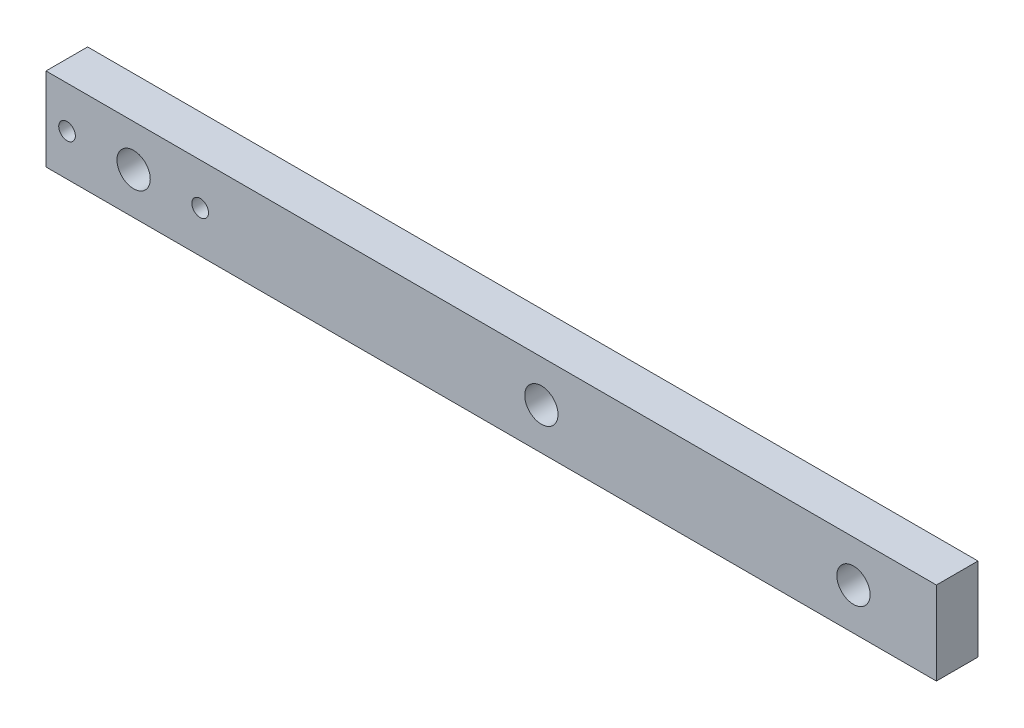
ISO-10303-21;
HEADER;
FILE_DESCRIPTION(('STEP AP214'),'2;1');
FILE_NAME('part.step','',(''),(''),'','','');
FILE_SCHEMA(('AUTOMOTIVE_DESIGN { 1 0 10303 214 1 1 1 1 }'));
ENDSEC;
DATA;
#1=APPLICATION_CONTEXT('core data for automotive mechanical design processes');
#2=APPLICATION_PROTOCOL_DEFINITION('international standard','automotive_design',2000,#1);
#3=PRODUCT_CONTEXT('',#1,'mechanical');
#4=PRODUCT('Part','Part','',(#3));
#5=PRODUCT_RELATED_PRODUCT_CATEGORY('part','',(#4));
#6=PRODUCT_DEFINITION_FORMATION('','',#4);
#7=PRODUCT_DEFINITION_CONTEXT('part definition',#1,'design');
#8=PRODUCT_DEFINITION('design','',#6,#7);
#9=PRODUCT_DEFINITION_SHAPE('','',#8);
#10=(LENGTH_UNIT() NAMED_UNIT(*) SI_UNIT(.MILLI.,.METRE.));
#11=(NAMED_UNIT(*) PLANE_ANGLE_UNIT() SI_UNIT($,.RADIAN.));
#12=(NAMED_UNIT(*) SI_UNIT($,.STERADIAN.) SOLID_ANGLE_UNIT());
#13=UNCERTAINTY_MEASURE_WITH_UNIT(LENGTH_MEASURE(1.E-05),#10,'distance_accuracy_value','');
#14=(GEOMETRIC_REPRESENTATION_CONTEXT(3) GLOBAL_UNCERTAINTY_ASSIGNED_CONTEXT((#13)) GLOBAL_UNIT_ASSIGNED_CONTEXT((#10,
#11,#12)) REPRESENTATION_CONTEXT('',''));
#15=CARTESIAN_POINT('',(0.,0.,0.));
#16=DIRECTION('',(0.,0.,1.));
#17=DIRECTION('',(1.,0.,0.));
#18=AXIS2_PLACEMENT_3D('',#15,#16,#17);
#19=CARTESIAN_POINT('',(-55.,5.,5.));
#20=DIRECTION('',(1.,0.,0.));
#21=DIRECTION('',(0.,0.,-1.));
#22=AXIS2_PLACEMENT_3D('',#19,#20,#21);
#23=PLANE('',#22);
#24=DIRECTION('',(0.,-1.,0.));
#25=VECTOR('',#24,1.);
#26=CARTESIAN_POINT('',(-55.,5.,0.));
#27=LINE('',#26,#25);
#28=CARTESIAN_POINT('',(-55.,5.,0.));
#29=VERTEX_POINT('',#28);
#30=CARTESIAN_POINT('',(-55.,-5.,0.));
#31=VERTEX_POINT('',#30);
#32=EDGE_CURVE('E100',#29,#31,#27,.T.);
#33=ORIENTED_EDGE('',*,*,#32,.T.);
#34=DIRECTION('',(0.,0.,-1.));
#35=VECTOR('',#34,1.);
#36=CARTESIAN_POINT('',(-55.,-5.,5.));
#37=LINE('',#36,#35);
#38=CARTESIAN_POINT('',(-55.,-5.,5.));
#39=VERTEX_POINT('',#38);
#40=EDGE_CURVE('E11',#39,#31,#37,.T.);
#41=ORIENTED_EDGE('',*,*,#40,.F.);
#42=DIRECTION('',(0.,-1.,0.));
#43=VECTOR('',#42,1.);
#44=CARTESIAN_POINT('',(-55.,5.,5.));
#45=LINE('',#44,#43);
#46=CARTESIAN_POINT('',(-55.,5.,5.));
#47=VERTEX_POINT('',#46);
#48=EDGE_CURVE('E88',#47,#39,#45,.T.);
#49=ORIENTED_EDGE('',*,*,#48,.F.);
#50=DIRECTION('',(0.,0.,-1.));
#51=VECTOR('',#50,1.);
#52=CARTESIAN_POINT('',(-55.,5.,5.));
#53=LINE('',#52,#51);
#54=EDGE_CURVE('E96',#47,#29,#53,.T.);
#55=ORIENTED_EDGE('',*,*,#54,.T.);
#56=EDGE_LOOP('',(#33,#41,#49,#55));
#57=FACE_BOUND('',#56,.T.);
#58=ADVANCED_FACE('F37',(#57),#23,.F.);
#59=CARTESIAN_POINT('',(-55.,-5.,5.));
#60=DIRECTION('',(0.,1.,0.));
#61=DIRECTION('',(0.,0.,1.));
#62=AXIS2_PLACEMENT_3D('',#59,#60,#61);
#63=PLANE('',#62);
#64=DIRECTION('',(1.,0.,0.));
#65=VECTOR('',#64,1.);
#66=CARTESIAN_POINT('',(-55.,-5.,0.));
#67=LINE('',#66,#65);
#68=CARTESIAN_POINT('',(52.,-5.,0.));
#69=VERTEX_POINT('',#68);
#70=EDGE_CURVE('E92',#31,#69,#67,.T.);
#71=ORIENTED_EDGE('',*,*,#70,.T.);
#72=DIRECTION('',(0.,0.,-1.));
#73=VECTOR('',#72,1.);
#74=CARTESIAN_POINT('',(52.,-5.,5.));
#75=LINE('',#74,#73);
#76=CARTESIAN_POINT('',(52.,-5.,5.));
#77=VERTEX_POINT('',#76);
#78=EDGE_CURVE('E45',#77,#69,#75,.T.);
#79=ORIENTED_EDGE('',*,*,#78,.F.);
#80=DIRECTION('',(1.,0.,0.));
#81=VECTOR('',#80,1.);
#82=CARTESIAN_POINT('',(-55.,-5.,5.));
#83=LINE('',#82,#81);
#84=EDGE_CURVE('E83',#39,#77,#83,.T.);
#85=ORIENTED_EDGE('',*,*,#84,.F.);
#86=ORIENTED_EDGE('',*,*,#40,.T.);
#87=EDGE_LOOP('',(#71,#79,#85,#86));
#88=FACE_BOUND('',#87,.T.);
#89=ADVANCED_FACE('F91',(#88),#63,.F.);
#90=CARTESIAN_POINT('',(52.,5.,5.));
#91=DIRECTION('',(-1.,0.,0.));
#92=DIRECTION('',(0.,0.,1.));
#93=AXIS2_PLACEMENT_3D('',#90,#91,#92);
#94=PLANE('',#93);
#95=DIRECTION('',(0.,1.,0.));
#96=VECTOR('',#95,1.);
#97=CARTESIAN_POINT('',(52.,5.,0.));
#98=LINE('',#97,#96);
#99=CARTESIAN_POINT('',(52.,5.,0.));
#100=VERTEX_POINT('',#99);
#101=EDGE_CURVE('E70',#69,#100,#98,.T.);
#102=ORIENTED_EDGE('',*,*,#101,.T.);
#103=DIRECTION('',(0.,0.,-1.));
#104=VECTOR('',#103,1.);
#105=CARTESIAN_POINT('',(52.,5.,5.));
#106=LINE('',#105,#104);
#107=CARTESIAN_POINT('',(52.,5.,5.));
#108=VERTEX_POINT('',#107);
#109=EDGE_CURVE('E93',#108,#100,#106,.T.);
#110=ORIENTED_EDGE('',*,*,#109,.F.);
#111=DIRECTION('',(0.,1.,0.));
#112=VECTOR('',#111,1.);
#113=CARTESIAN_POINT('',(52.,5.,5.));
#114=LINE('',#113,#112);
#115=EDGE_CURVE('E86',#77,#108,#114,.T.);
#116=ORIENTED_EDGE('',*,*,#115,.F.);
#117=ORIENTED_EDGE('',*,*,#78,.T.);
#118=EDGE_LOOP('',(#102,#110,#116,#117));
#119=FACE_BOUND('',#118,.T.);
#120=ADVANCED_FACE('F94',(#119),#94,.F.);
#121=CARTESIAN_POINT('',(-55.,5.,5.));
#122=DIRECTION('',(0.,-1.,0.));
#123=DIRECTION('',(0.,0.,-1.));
#124=AXIS2_PLACEMENT_3D('',#121,#122,#123);
#125=PLANE('',#124);
#126=DIRECTION('',(-1.,0.,0.));
#127=VECTOR('',#126,1.);
#128=CARTESIAN_POINT('',(-55.,5.,0.));
#129=LINE('',#128,#127);
#130=EDGE_CURVE('E76',#100,#29,#129,.T.);
#131=ORIENTED_EDGE('',*,*,#130,.T.);
#132=ORIENTED_EDGE('',*,*,#54,.F.);
#133=DIRECTION('',(-1.,0.,0.));
#134=VECTOR('',#133,1.);
#135=CARTESIAN_POINT('',(-55.,5.,5.));
#136=LINE('',#135,#134);
#137=EDGE_CURVE('E53',#108,#47,#136,.T.);
#138=ORIENTED_EDGE('',*,*,#137,.F.);
#139=ORIENTED_EDGE('',*,*,#109,.T.);
#140=EDGE_LOOP('',(#131,#132,#138,#139));
#141=FACE_BOUND('',#140,.T.);
#142=ADVANCED_FACE('F108',(#141),#125,.F.);
#143=CARTESIAN_POINT('',(0.,0.,5.));
#144=DIRECTION('',(0.,0.,1.));
#145=DIRECTION('',(1.,0.,0.));
#146=AXIS2_PLACEMENT_3D('',#143,#144,#145);
#147=PLANE('',#146);
#148=CARTESIAN_POINT('',(4.5294865,0.,5.));
#149=DIRECTION('',(0.,0.,1.));
#150=DIRECTION('',(1.,0.,0.));
#151=AXIS2_PLACEMENT_3D('',#148,#149,#150);
#152=CIRCLE('',#151,2.);
#153=CARTESIAN_POINT('',(6.5294865,0.,5.));
#154=VERTEX_POINT('',#153);
#155=EDGE_CURVE('E138',#154,#154,#152,.T.);
#156=ORIENTED_EDGE('',*,*,#155,.F.);
#157=EDGE_LOOP('',(#156));
#158=FACE_BOUND('',#157,.T.);
#159=CARTESIAN_POINT('',(42.035938,0.,5.));
#160=DIRECTION('',(0.,0.,1.));
#161=DIRECTION('',(1.,0.,0.));
#162=AXIS2_PLACEMENT_3D('',#159,#160,#161);
#163=CIRCLE('',#162,2.);
#164=CARTESIAN_POINT('',(44.035938,0.,5.));
#165=VERTEX_POINT('',#164);
#166=EDGE_CURVE('E132',#165,#165,#163,.T.);
#167=ORIENTED_EDGE('',*,*,#166,.F.);
#168=EDGE_LOOP('',(#167));
#169=FACE_BOUND('',#168,.T.);
#170=CARTESIAN_POINT('',(-36.4705135,0.,5.));
#171=DIRECTION('',(0.,0.,1.));
#172=DIRECTION('',(1.,0.,0.));
#173=AXIS2_PLACEMENT_3D('',#170,#171,#172);
#174=CIRCLE('',#173,0.999999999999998);
#175=CARTESIAN_POINT('',(-35.4705135,0.,5.));
#176=VERTEX_POINT('',#175);
#177=EDGE_CURVE('E126',#176,#176,#174,.T.);
#178=ORIENTED_EDGE('',*,*,#177,.F.);
#179=EDGE_LOOP('',(#178));
#180=FACE_BOUND('',#179,.T.);
#181=CARTESIAN_POINT('',(-52.4705135,0.,5.));
#182=DIRECTION('',(0.,0.,1.));
#183=DIRECTION('',(1.,0.,0.));
#184=AXIS2_PLACEMENT_3D('',#181,#182,#183);
#185=CIRCLE('',#184,0.999999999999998);
#186=CARTESIAN_POINT('',(-51.4705135,0.,5.));
#187=VERTEX_POINT('',#186);
#188=EDGE_CURVE('E120',#187,#187,#185,.T.);
#189=ORIENTED_EDGE('',*,*,#188,.F.);
#190=EDGE_LOOP('',(#189));
#191=FACE_BOUND('',#190,.T.);
#192=CARTESIAN_POINT('',(-44.4705135,0.,5.));
#193=DIRECTION('',(0.,0.,1.));
#194=DIRECTION('',(1.,0.,0.));
#195=AXIS2_PLACEMENT_3D('',#192,#193,#194);
#196=CIRCLE('',#195,2.);
#197=CARTESIAN_POINT('',(-42.4705135,0.,5.));
#198=VERTEX_POINT('',#197);
#199=EDGE_CURVE('E114',#198,#198,#196,.T.);
#200=ORIENTED_EDGE('',*,*,#199,.F.);
#201=EDGE_LOOP('',(#200));
#202=FACE_BOUND('',#201,.T.);
#203=ORIENTED_EDGE('',*,*,#48,.T.);
#204=ORIENTED_EDGE('',*,*,#84,.T.);
#205=ORIENTED_EDGE('',*,*,#115,.T.);
#206=ORIENTED_EDGE('',*,*,#137,.T.);
#207=EDGE_LOOP('',(#203,#204,#205,#206));
#208=FACE_BOUND('',#207,.T.);
#209=ADVANCED_FACE('F84',(#158,#169,#180,#191,#202,#208),#147,.T.);
#210=CARTESIAN_POINT('',(0.,0.,0.));
#211=DIRECTION('',(0.,0.,1.));
#212=DIRECTION('',(1.,0.,0.));
#213=AXIS2_PLACEMENT_3D('',#210,#211,#212);
#214=PLANE('',#213);
#215=CARTESIAN_POINT('',(4.5294865,0.,0.));
#216=DIRECTION('',(0.,0.,1.));
#217=DIRECTION('',(1.,0.,0.));
#218=AXIS2_PLACEMENT_3D('',#215,#216,#217);
#219=CIRCLE('',#218,2.);
#220=CARTESIAN_POINT('',(6.5294865,0.,0.));
#221=VERTEX_POINT('',#220);
#222=EDGE_CURVE('E135',#221,#221,#219,.T.);
#223=ORIENTED_EDGE('',*,*,#222,.T.);
#224=EDGE_LOOP('',(#223));
#225=FACE_BOUND('',#224,.T.);
#226=CARTESIAN_POINT('',(42.035938,0.,0.));
#227=DIRECTION('',(0.,0.,1.));
#228=DIRECTION('',(1.,0.,0.));
#229=AXIS2_PLACEMENT_3D('',#226,#227,#228);
#230=CIRCLE('',#229,2.);
#231=CARTESIAN_POINT('',(44.035938,0.,0.));
#232=VERTEX_POINT('',#231);
#233=EDGE_CURVE('E129',#232,#232,#230,.T.);
#234=ORIENTED_EDGE('',*,*,#233,.T.);
#235=EDGE_LOOP('',(#234));
#236=FACE_BOUND('',#235,.T.);
#237=CARTESIAN_POINT('',(-36.4705135,0.,0.));
#238=DIRECTION('',(0.,0.,1.));
#239=DIRECTION('',(1.,0.,0.));
#240=AXIS2_PLACEMENT_3D('',#237,#238,#239);
#241=CIRCLE('',#240,0.999999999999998);
#242=CARTESIAN_POINT('',(-35.4705135,0.,0.));
#243=VERTEX_POINT('',#242);
#244=EDGE_CURVE('E123',#243,#243,#241,.T.);
#245=ORIENTED_EDGE('',*,*,#244,.T.);
#246=EDGE_LOOP('',(#245));
#247=FACE_BOUND('',#246,.T.);
#248=CARTESIAN_POINT('',(-52.4705135,0.,0.));
#249=DIRECTION('',(0.,0.,1.));
#250=DIRECTION('',(1.,0.,0.));
#251=AXIS2_PLACEMENT_3D('',#248,#249,#250);
#252=CIRCLE('',#251,0.999999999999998);
#253=CARTESIAN_POINT('',(-51.4705135,0.,0.));
#254=VERTEX_POINT('',#253);
#255=EDGE_CURVE('E117',#254,#254,#252,.T.);
#256=ORIENTED_EDGE('',*,*,#255,.T.);
#257=EDGE_LOOP('',(#256));
#258=FACE_BOUND('',#257,.T.);
#259=CARTESIAN_POINT('',(-44.4705135,0.,0.));
#260=DIRECTION('',(0.,0.,1.));
#261=DIRECTION('',(1.,0.,0.));
#262=AXIS2_PLACEMENT_3D('',#259,#260,#261);
#263=CIRCLE('',#262,2.);
#264=CARTESIAN_POINT('',(-42.4705135,0.,0.));
#265=VERTEX_POINT('',#264);
#266=EDGE_CURVE('E103',#265,#265,#263,.T.);
#267=ORIENTED_EDGE('',*,*,#266,.T.);
#268=EDGE_LOOP('',(#267));
#269=FACE_BOUND('',#268,.T.);
#270=ORIENTED_EDGE('',*,*,#32,.F.);
#271=ORIENTED_EDGE('',*,*,#130,.F.);
#272=ORIENTED_EDGE('',*,*,#101,.F.);
#273=ORIENTED_EDGE('',*,*,#70,.F.);
#274=EDGE_LOOP('',(#270,#271,#272,#273));
#275=FACE_BOUND('',#274,.T.);
#276=ADVANCED_FACE('F111',(#225,#236,#247,#258,#269,#275),#214,.F.);
#277=CARTESIAN_POINT('',(-44.4705135,0.,0.));
#278=DIRECTION('',(0.,0.,1.));
#279=DIRECTION('',(1.,0.,0.));
#280=AXIS2_PLACEMENT_3D('',#277,#278,#279);
#281=CYLINDRICAL_SURFACE('',#280,2.);
#282=ORIENTED_EDGE('',*,*,#266,.F.);
#283=EDGE_LOOP('',(#282));
#284=FACE_BOUND('',#283,.T.);
#285=ORIENTED_EDGE('',*,*,#199,.T.);
#286=EDGE_LOOP('',(#285));
#287=FACE_BOUND('',#286,.T.);
#288=ADVANCED_FACE('F164',(#284,#287),#281,.F.);
#289=CARTESIAN_POINT('',(-52.4705135,0.,0.));
#290=DIRECTION('',(0.,0.,1.));
#291=DIRECTION('',(1.,0.,0.));
#292=AXIS2_PLACEMENT_3D('',#289,#290,#291);
#293=CYLINDRICAL_SURFACE('',#292,0.999999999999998);
#294=ORIENTED_EDGE('',*,*,#255,.F.);
#295=EDGE_LOOP('',(#294));
#296=FACE_BOUND('',#295,.T.);
#297=ORIENTED_EDGE('',*,*,#188,.T.);
#298=EDGE_LOOP('',(#297));
#299=FACE_BOUND('',#298,.T.);
#300=ADVANCED_FACE('F166',(#296,#299),#293,.F.);
#301=CARTESIAN_POINT('',(-36.4705135,0.,0.));
#302=DIRECTION('',(0.,0.,1.));
#303=DIRECTION('',(1.,0.,0.));
#304=AXIS2_PLACEMENT_3D('',#301,#302,#303);
#305=CYLINDRICAL_SURFACE('',#304,0.999999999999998);
#306=ORIENTED_EDGE('',*,*,#244,.F.);
#307=EDGE_LOOP('',(#306));
#308=FACE_BOUND('',#307,.T.);
#309=ORIENTED_EDGE('',*,*,#177,.T.);
#310=EDGE_LOOP('',(#309));
#311=FACE_BOUND('',#310,.T.);
#312=ADVANCED_FACE('F173',(#308,#311),#305,.F.);
#313=CARTESIAN_POINT('',(42.035938,0.,0.));
#314=DIRECTION('',(0.,0.,1.));
#315=DIRECTION('',(1.,0.,0.));
#316=AXIS2_PLACEMENT_3D('',#313,#314,#315);
#317=CYLINDRICAL_SURFACE('',#316,2.);
#318=ORIENTED_EDGE('',*,*,#233,.F.);
#319=EDGE_LOOP('',(#318));
#320=FACE_BOUND('',#319,.T.);
#321=ORIENTED_EDGE('',*,*,#166,.T.);
#322=EDGE_LOOP('',(#321));
#323=FACE_BOUND('',#322,.T.);
#324=ADVANCED_FACE('F149',(#320,#323),#317,.F.);
#325=CARTESIAN_POINT('',(4.5294865,0.,0.));
#326=DIRECTION('',(0.,0.,1.));
#327=DIRECTION('',(1.,0.,0.));
#328=AXIS2_PLACEMENT_3D('',#325,#326,#327);
#329=CYLINDRICAL_SURFACE('',#328,2.);
#330=ORIENTED_EDGE('',*,*,#222,.F.);
#331=EDGE_LOOP('',(#330));
#332=FACE_BOUND('',#331,.T.);
#333=ORIENTED_EDGE('',*,*,#155,.T.);
#334=EDGE_LOOP('',(#333));
#335=FACE_BOUND('',#334,.T.);
#336=ADVANCED_FACE('F146',(#332,#335),#329,.F.);
#337=CLOSED_SHELL('',(#58,#89,#120,#142,#209,#276,#288,#300,#312,#324,#336));
#338=MANIFOLD_SOLID_BREP('B2',#337);
#339=ADVANCED_BREP_SHAPE_REPRESENTATION('',(#18,#338),#14);
#340=SHAPE_DEFINITION_REPRESENTATION(#9,#339);
ENDSEC;
END-ISO-10303-21;
